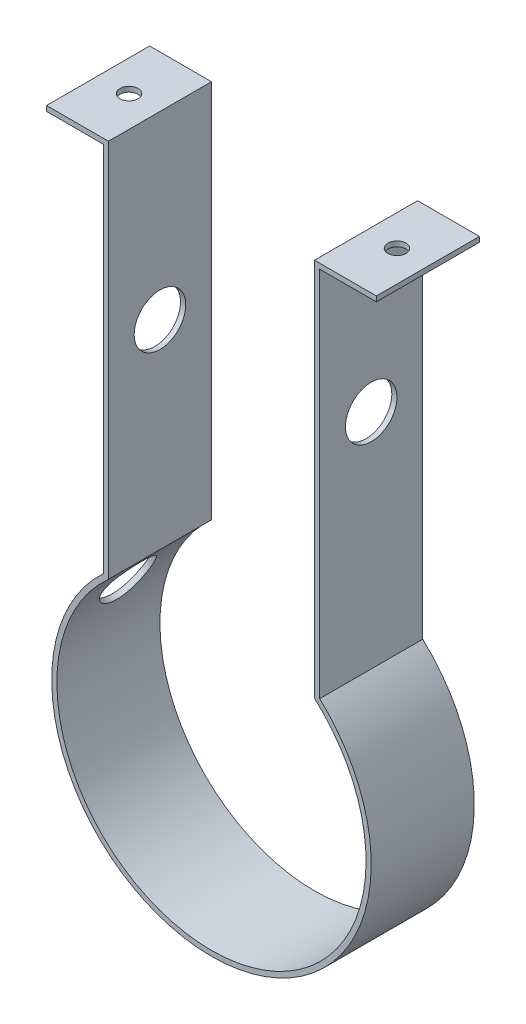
from build123d import *

# Parameters (mm, degrees)
EXTRUDE1_DEPTH = 20
SKETCH2_R      = 1.75
EXTRUDE2_DEPTH = 20
SKETCH3_R      = 5
EXTRUDE3_DEPTH = 20
SKETCH4_R      = 5
EXTRUDE4_DEPTH = 20
SKETCH6_R      = 5
EXTRUDE5_DEPTH = 20


with BuildPart() as part:
    # Sketch1 → Extrude1 (new body)
    with BuildSketch(Plane.XY):
        with BuildLine():
            Line((-20, 22.360679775), (-20, 96))
            Line((-20, 96), (-32, 96))
            Line((-32, 96), (-32, 95))
            Line((-32, 95), (-21, 95))
            Line((-21, 95), (-21, 22.803508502))
            ThreePointArc((-21, 22.803508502), (0, -31), (21, 22.803508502))
            Line((21, 22.803508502), (21, 95))
            Line((21, 95), (32, 95))
            Line((32, 95), (32, 96))
            Line((32, 96), (20, 96))
            Line((20, 96), (20, 22.360679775))
            ThreePointArc((20, 22.360679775), (0, -30), (-20, 22.360679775))
        make_face()
    extrude(amount=EXTRUDE1_DEPTH)

    # Sketch2 → Extrude2 (cut)
    with BuildSketch(Plane(origin=(0, 96, 0), x_dir=(1, 0, 0), z_dir=(0, 1, 0))):
        with Locations(Location((26, -10, 0), (0, 0, 270))):
            Circle(SKETCH2_R)
        with Locations(Location((-26, -10, 0), (0, 0, 270))):
            Circle(SKETCH2_R)
    extrude(amount=-EXTRUDE2_DEPTH, mode=Mode.SUBTRACT)

    # Sketch3 → Extrude3 (cut)
    with BuildSketch(Plane(origin=(21, 0, 0), x_dir=(0, 0, -1), z_dir=(1, 0, 0))):
        with Locations((-10, 66)):
            Circle(SKETCH3_R)
    extrude(amount=-EXTRUDE3_DEPTH, mode=Mode.SUBTRACT)

    # Sketch4 → Extrude4 (cut)
    with BuildSketch(Plane.ZY.offset(21)):
        with Locations((10, 61)):
            Circle(SKETCH4_R)
    extrude(amount=-EXTRUDE4_DEPTH, mode=Mode.SUBTRACT)

    # Sketch6 → Extrude5 (cut)
    with BuildSketch(Plane(origin=(-40.546461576, 22.285161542, 0), x_dir=(0, 0, 1), z_dir=(-0.8763563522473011, 0.48166330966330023, 0))):
        with Locations(Location((10, 0, 0), (0, 0, 270))):
            Circle(SKETCH6_R)
    extrude(amount=-EXTRUDE5_DEPTH, mode=Mode.SUBTRACT)


solid = part.part
